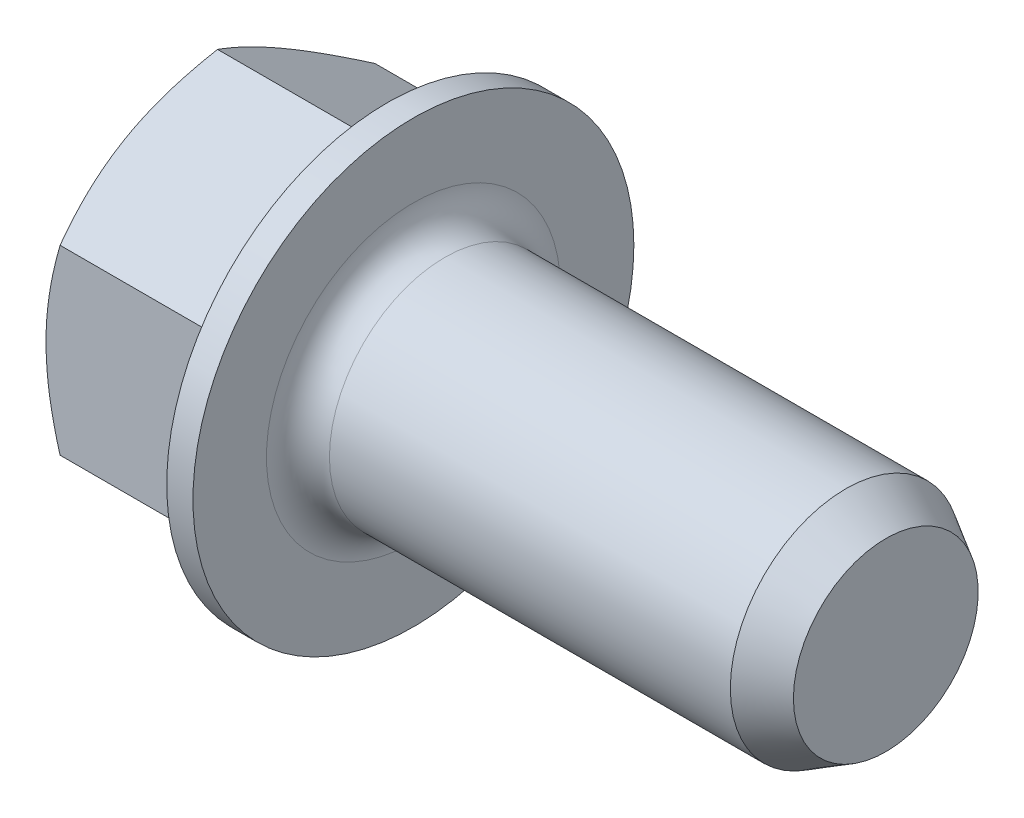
from build123d import *

# Parameters (mm, degrees)
EXTRUDE1_DEPTH = 2
SKETCH4_W      = 1.05
SKETCH4_H      = 1.2
CHAMFER1_SIZE  = 0.22
CHAMFER1_SIZE2 = 0.381051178
FILLET1_R      = 0.3
FILLET2_R      = 0.2


with BuildPart() as part:
    # Sketch1 → Revolve1 (revolve)
    with BuildSketch(Plane.XY, mode=Mode.PRIVATE) as revolve1_sk:
        Polygon((0, 0), (0, 1.32), (1.75, 1.32), (1.75, 2.1), (2, 2.1), (2, 1.1), (6.5, 1.1), (6.5, 0), align=None)
    revolve(revolve1_sk.sketch.rotate(Axis((13.107885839, 0, 0), (-1, 0, 0)), 90), axis=Axis((13.107885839, 0, 0), (-1, 0, 0)))

    # Sketch2 → Extrude1 (add)
    with BuildSketch(Plane.ZY):
        Polygon((1.5, -0.866025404), (1.5, 0.866025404), (0, 1.732050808), (-1.5, 0.866025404), (-1.5, -0.866025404), (0, -1.732050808), align=None)
    extrude(amount=-EXTRUDE1_DEPTH)

    # Sketch3 → Cut-Revolve2 (revolve, cut)
    with BuildSketch(Plane(origin=(0, 0, 0), x_dir=(1, 0, 0), z_dir=(0, 1, 0))):
        Polygon((-0.866025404, 0), (7.794228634, 15), (-0.966025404, 15), (-0.966025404, 0), align=None)
    revolve(axis=Axis((0, 0, 0), (-1, 0, 0)), mode=Mode.SUBTRACT)

    # Sketch4 → Cut-Revolve3 (revolve, cut)
    with BuildSketch(Plane.XY, mode=Mode.PRIVATE) as cut_revolve3_sk:
        with Locations((0.325, 0.6)):
            Rectangle(SKETCH4_W, SKETCH4_H)
    revolve(cut_revolve3_sk.sketch.rotate(Axis((0, 0, 0), (1, 0, 0)), 180), axis=Axis((0, 0, 0), (1, 0, 0)), mode=Mode.SUBTRACT)

    # Chamfer1
    chamfer1_edges = [part.edges().sort_by_distance(p)[0] for p in [
        (6.5, 0, 1.1),
    ]]
    chamfer1_side = [part.faces().sort_by_distance(p)[0] for p in [
        (6.5, 0, 0),
    ]]
    chamfer(chamfer1_edges, length=CHAMFER1_SIZE, length2=CHAMFER1_SIZE2, reference=chamfer1_side[0])

    # Fillet1
    fillet1_edges = [part.edges().sort_by_distance(p)[0] for p in [
        (2, 0, 1.1),
    ]]
    fillet(fillet1_edges, radius=FILLET1_R)

    # Fillet2
    fillet2_edges = [part.edges().sort_by_distance(p)[0] for p in [
        (1.75, -1.299038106, 0.75),
        (1.75, -1.299038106, -0.75),
        (1.75, 0, -1.5),
        (1.75, 1.299038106, -0.75),
        (1.75, 1.299038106, 0.75),
        (1.75, 0, 1.5),
    ]]
    fillet(fillet2_edges, radius=FILLET2_R)


solid = part.part
